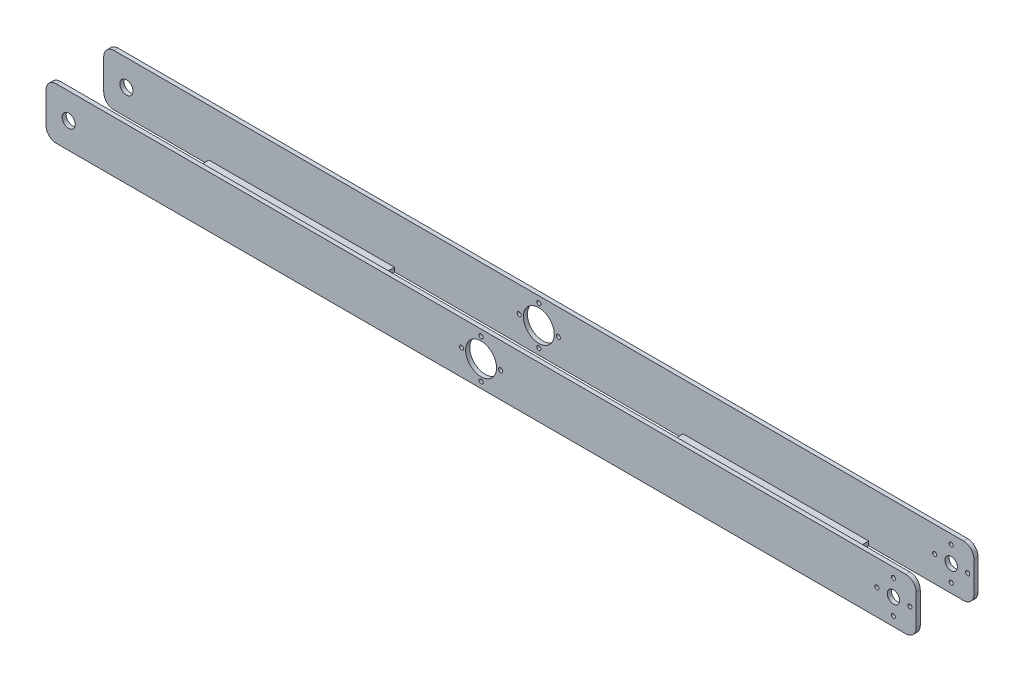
ISO-10303-21;
HEADER;
FILE_DESCRIPTION(('STEP AP214'),'2;1');
FILE_NAME('part.step','',(''),(''),'','','');
FILE_SCHEMA(('AUTOMOTIVE_DESIGN { 1 0 10303 214 1 1 1 1 }'));
ENDSEC;
DATA;
#1=APPLICATION_CONTEXT('core data for automotive mechanical design processes');
#2=APPLICATION_PROTOCOL_DEFINITION('international standard','automotive_design',2000,#1);
#3=PRODUCT_CONTEXT('',#1,'mechanical');
#4=PRODUCT('Part','Part','',(#3));
#5=PRODUCT_RELATED_PRODUCT_CATEGORY('part','',(#4));
#6=PRODUCT_DEFINITION_FORMATION('','',#4);
#7=PRODUCT_DEFINITION_CONTEXT('part definition',#1,'design');
#8=PRODUCT_DEFINITION('design','',#6,#7);
#9=PRODUCT_DEFINITION_SHAPE('','',#8);
#10=(LENGTH_UNIT() NAMED_UNIT(*) SI_UNIT(.MILLI.,.METRE.));
#11=(NAMED_UNIT(*) PLANE_ANGLE_UNIT() SI_UNIT($,.RADIAN.));
#12=(NAMED_UNIT(*) SI_UNIT($,.STERADIAN.) SOLID_ANGLE_UNIT());
#13=UNCERTAINTY_MEASURE_WITH_UNIT(LENGTH_MEASURE(1.E-05),#10,'distance_accuracy_value','');
#14=(GEOMETRIC_REPRESENTATION_CONTEXT(3) GLOBAL_UNCERTAINTY_ASSIGNED_CONTEXT((#13)) GLOBAL_UNIT_ASSIGNED_CONTEXT((#10,
#11,#12)) REPRESENTATION_CONTEXT('',''));
#15=CARTESIAN_POINT('',(0.,0.,0.));
#16=DIRECTION('',(0.,0.,1.));
#17=DIRECTION('',(1.,0.,0.));
#18=AXIS2_PLACEMENT_3D('',#15,#16,#17);
#19=CARTESIAN_POINT('',(211.,12.5,30.));
#20=DIRECTION('',(-1.,0.,0.));
#21=DIRECTION('',(0.,0.,1.));
#22=AXIS2_PLACEMENT_3D('',#19,#20,#21);
#23=PLANE('',#22);
#24=DIRECTION('',(0.,1.,0.));
#25=VECTOR('',#24,1.);
#26=CARTESIAN_POINT('',(211.,12.5,30.));
#27=LINE('',#26,#25);
#28=CARTESIAN_POINT('',(211.,-7.5,30.));
#29=VERTEX_POINT('',#28);
#30=CARTESIAN_POINT('',(211.,7.5,30.));
#31=VERTEX_POINT('',#30);
#32=EDGE_CURVE('E302',#29,#31,#27,.T.);
#33=ORIENTED_EDGE('',*,*,#32,.F.);
#34=DIRECTION('',(0.,0.,-1.));
#35=VECTOR('',#34,1.);
#36=CARTESIAN_POINT('',(211.,-7.5,30.));
#37=LINE('',#36,#35);
#38=CARTESIAN_POINT('',(211.,-7.5,28.));
#39=VERTEX_POINT('',#38);
#40=EDGE_CURVE('E403',#29,#39,#37,.T.);
#41=ORIENTED_EDGE('',*,*,#40,.T.);
#42=DIRECTION('',(0.,1.,0.));
#43=VECTOR('',#42,1.);
#44=CARTESIAN_POINT('',(211.,12.5,28.));
#45=LINE('',#44,#43);
#46=CARTESIAN_POINT('',(211.,7.5,28.));
#47=VERTEX_POINT('',#46);
#48=EDGE_CURVE('E299',#39,#47,#45,.T.);
#49=ORIENTED_EDGE('',*,*,#48,.T.);
#50=DIRECTION('',(0.,0.,-1.));
#51=VECTOR('',#50,1.);
#52=CARTESIAN_POINT('',(211.,7.5,30.));
#53=LINE('',#52,#51);
#54=EDGE_CURVE('E401',#47,#31,#53,.F.);
#55=ORIENTED_EDGE('',*,*,#54,.T.);
#56=EDGE_LOOP('',(#33,#41,#49,#55));
#57=FACE_BOUND('',#56,.T.);
#58=ADVANCED_FACE('F41',(#57),#23,.F.);
#59=CARTESIAN_POINT('',(-211.,-12.5,30.));
#60=DIRECTION('',(1.,0.,0.));
#61=DIRECTION('',(0.,0.,-1.));
#62=AXIS2_PLACEMENT_3D('',#59,#60,#61);
#63=PLANE('',#62);
#64=DIRECTION('',(0.,-1.,0.));
#65=VECTOR('',#64,1.);
#66=CARTESIAN_POINT('',(-211.,-12.5,0.));
#67=LINE('',#66,#65);
#68=CARTESIAN_POINT('',(-211.,7.5,0.));
#69=VERTEX_POINT('',#68);
#70=CARTESIAN_POINT('',(-211.,-7.5,0.));
#71=VERTEX_POINT('',#70);
#72=EDGE_CURVE('E320',#69,#71,#67,.T.);
#73=ORIENTED_EDGE('',*,*,#72,.T.);
#74=DIRECTION('',(0.,0.,-1.));
#75=VECTOR('',#74,1.);
#76=CARTESIAN_POINT('',(-211.,-7.5,30.));
#77=LINE('',#76,#75);
#78=CARTESIAN_POINT('',(-211.,-7.5,2.));
#79=VERTEX_POINT('',#78);
#80=EDGE_CURVE('E434',#71,#79,#77,.F.);
#81=ORIENTED_EDGE('',*,*,#80,.T.);
#82=DIRECTION('',(0.,-1.,0.));
#83=VECTOR('',#82,1.);
#84=CARTESIAN_POINT('',(-211.,-12.5,2.));
#85=LINE('',#84,#83);
#86=CARTESIAN_POINT('',(-211.,7.5,2.));
#87=VERTEX_POINT('',#86);
#88=EDGE_CURVE('E283',#87,#79,#85,.T.);
#89=ORIENTED_EDGE('',*,*,#88,.F.);
#90=DIRECTION('',(0.,0.,-1.));
#91=VECTOR('',#90,1.);
#92=CARTESIAN_POINT('',(-211.,7.5,30.));
#93=LINE('',#92,#91);
#94=EDGE_CURVE('E431',#87,#69,#93,.T.);
#95=ORIENTED_EDGE('',*,*,#94,.T.);
#96=EDGE_LOOP('',(#73,#81,#89,#95));
#97=FACE_BOUND('',#96,.T.);
#98=ADVANCED_FACE('F468',(#97),#63,.F.);
#99=CARTESIAN_POINT('',(-211.,-10.5,30.));
#100=DIRECTION('',(0.,1.,0.));
#101=DIRECTION('',(0.,0.,1.));
#102=AXIS2_PLACEMENT_3D('',#99,#100,#101);
#103=PLANE('',#102);
#104=DIRECTION('',(0.,0.,-1.));
#105=VECTOR('',#104,1.);
#106=CARTESIAN_POINT('',(-160.,-10.5,30.));
#107=LINE('',#106,#105);
#108=CARTESIAN_POINT('',(-160.,-10.5,28.));
#109=VERTEX_POINT('',#108);
#110=CARTESIAN_POINT('',(-160.,-10.5,2.));
#111=VERTEX_POINT('',#110);
#112=EDGE_CURVE('E276',#109,#111,#107,.T.);
#113=ORIENTED_EDGE('',*,*,#112,.F.);
#114=DIRECTION('',(1.,0.,0.));
#115=VECTOR('',#114,1.);
#116=CARTESIAN_POINT('',(-211.,-10.5,28.));
#117=LINE('',#116,#115);
#118=CARTESIAN_POINT('',(-70.,-10.5,28.));
#119=VERTEX_POINT('',#118);
#120=EDGE_CURVE('E221',#109,#119,#117,.T.);
#121=ORIENTED_EDGE('',*,*,#120,.T.);
#122=DIRECTION('',(0.,0.,1.));
#123=VECTOR('',#122,1.);
#124=CARTESIAN_POINT('',(-70.,-10.5,30.));
#125=LINE('',#124,#123);
#126=CARTESIAN_POINT('',(-70.,-10.5,2.));
#127=VERTEX_POINT('',#126);
#128=EDGE_CURVE('E273',#127,#119,#125,.T.);
#129=ORIENTED_EDGE('',*,*,#128,.F.);
#130=DIRECTION('',(1.,0.,0.));
#131=VECTOR('',#130,1.);
#132=CARTESIAN_POINT('',(-211.,-10.5,2.));
#133=LINE('',#132,#131);
#134=EDGE_CURVE('E282',#111,#127,#133,.T.);
#135=ORIENTED_EDGE('',*,*,#134,.F.);
#136=EDGE_LOOP('',(#113,#121,#129,#135));
#137=FACE_BOUND('',#136,.T.);
#138=ADVANCED_FACE('F474',(#137),#103,.T.);
#139=DIRECTION('',(0.,1.,0.));
#140=VECTOR('',#139,1.);
#141=CARTESIAN_POINT('',(211.,12.5,2.));
#142=LINE('',#141,#140);
#143=CARTESIAN_POINT('',(211.,-7.5,2.));
#144=VERTEX_POINT('',#143);
#145=CARTESIAN_POINT('',(211.,7.5,2.));
#146=VERTEX_POINT('',#145);
#147=EDGE_CURVE('E278',#144,#146,#142,.T.);
#148=ORIENTED_EDGE('',*,*,#147,.F.);
#149=DIRECTION('',(0.,0.,-1.));
#150=VECTOR('',#149,1.);
#151=CARTESIAN_POINT('',(211.,-7.5,30.));
#152=LINE('',#151,#150);
#153=CARTESIAN_POINT('',(211.,-7.5,0.));
#154=VERTEX_POINT('',#153);
#155=EDGE_CURVE('E374',#144,#154,#152,.T.);
#156=ORIENTED_EDGE('',*,*,#155,.T.);
#157=DIRECTION('',(0.,1.,0.));
#158=VECTOR('',#157,1.);
#159=CARTESIAN_POINT('',(211.,12.5,0.));
#160=LINE('',#159,#158);
#161=CARTESIAN_POINT('',(211.,7.5,0.));
#162=VERTEX_POINT('',#161);
#163=EDGE_CURVE('E314',#154,#162,#160,.T.);
#164=ORIENTED_EDGE('',*,*,#163,.T.);
#165=DIRECTION('',(0.,0.,-1.));
#166=VECTOR('',#165,1.);
#167=CARTESIAN_POINT('',(211.,7.5,30.));
#168=LINE('',#167,#166);
#169=EDGE_CURVE('E313',#162,#146,#168,.F.);
#170=ORIENTED_EDGE('',*,*,#169,.T.);
#171=EDGE_LOOP('',(#148,#156,#164,#170));
#172=FACE_BOUND('',#171,.T.);
#173=ADVANCED_FACE('F470',(#172),#23,.F.);
#174=CARTESIAN_POINT('',(-211.,12.5,30.));
#175=DIRECTION('',(0.,-1.,0.));
#176=DIRECTION('',(0.,0.,-1.));
#177=AXIS2_PLACEMENT_3D('',#174,#175,#176);
#178=PLANE('',#177);
#179=DIRECTION('',(-1.,0.,0.));
#180=VECTOR('',#179,1.);
#181=CARTESIAN_POINT('',(-211.,12.5,2.));
#182=LINE('',#181,#180);
#183=CARTESIAN_POINT('',(206.,12.5,2.));
#184=VERTEX_POINT('',#183);
#185=CARTESIAN_POINT('',(-206.,12.5,2.));
#186=VERTEX_POINT('',#185);
#187=EDGE_CURVE('E290',#184,#186,#182,.T.);
#188=ORIENTED_EDGE('',*,*,#187,.F.);
#189=DIRECTION('',(0.,0.,-1.));
#190=VECTOR('',#189,1.);
#191=CARTESIAN_POINT('',(206.,12.5,30.));
#192=LINE('',#191,#190);
#193=CARTESIAN_POINT('',(206.,12.5,0.));
#194=VERTEX_POINT('',#193);
#195=EDGE_CURVE('E428',#184,#194,#192,.T.);
#196=ORIENTED_EDGE('',*,*,#195,.T.);
#197=DIRECTION('',(-1.,0.,0.));
#198=VECTOR('',#197,1.);
#199=CARTESIAN_POINT('',(-211.,12.5,0.));
#200=LINE('',#199,#198);
#201=CARTESIAN_POINT('',(-206.,12.5,0.));
#202=VERTEX_POINT('',#201);
#203=EDGE_CURVE('E317',#194,#202,#200,.T.);
#204=ORIENTED_EDGE('',*,*,#203,.T.);
#205=DIRECTION('',(0.,0.,-1.));
#206=VECTOR('',#205,1.);
#207=CARTESIAN_POINT('',(-206.,12.5,30.));
#208=LINE('',#207,#206);
#209=EDGE_CURVE('E426',#202,#186,#208,.F.);
#210=ORIENTED_EDGE('',*,*,#209,.T.);
#211=EDGE_LOOP('',(#188,#196,#204,#210));
#212=FACE_BOUND('',#211,.T.);
#213=ADVANCED_FACE('F480',(#212),#178,.F.);
#214=DIRECTION('',(0.,-1.,0.));
#215=VECTOR('',#214,1.);
#216=CARTESIAN_POINT('',(-211.,-12.5,28.));
#217=LINE('',#216,#215);
#218=CARTESIAN_POINT('',(-211.,7.5,28.));
#219=VERTEX_POINT('',#218);
#220=CARTESIAN_POINT('',(-211.,-7.5,28.));
#221=VERTEX_POINT('',#220);
#222=EDGE_CURVE('E287',#219,#221,#217,.T.);
#223=ORIENTED_EDGE('',*,*,#222,.T.);
#224=DIRECTION('',(0.,0.,-1.));
#225=VECTOR('',#224,1.);
#226=CARTESIAN_POINT('',(-211.,-7.5,30.));
#227=LINE('',#226,#225);
#228=CARTESIAN_POINT('',(-211.,-7.5,30.));
#229=VERTEX_POINT('',#228);
#230=EDGE_CURVE('E11',#221,#229,#227,.F.);
#231=ORIENTED_EDGE('',*,*,#230,.T.);
#232=DIRECTION('',(0.,-1.,0.));
#233=VECTOR('',#232,1.);
#234=CARTESIAN_POINT('',(-211.,-12.5,30.));
#235=LINE('',#234,#233);
#236=CARTESIAN_POINT('',(-211.,7.5,30.));
#237=VERTEX_POINT('',#236);
#238=EDGE_CURVE('E308',#237,#229,#235,.T.);
#239=ORIENTED_EDGE('',*,*,#238,.F.);
#240=DIRECTION('',(0.,0.,-1.));
#241=VECTOR('',#240,1.);
#242=CARTESIAN_POINT('',(-211.,7.5,30.));
#243=LINE('',#242,#241);
#244=EDGE_CURVE('E49',#237,#219,#243,.T.);
#245=ORIENTED_EDGE('',*,*,#244,.T.);
#246=EDGE_LOOP('',(#223,#231,#239,#245));
#247=FACE_BOUND('',#246,.T.);
#248=ADVANCED_FACE('F438',(#247),#63,.F.);
#249=DIRECTION('',(-1.,0.,0.));
#250=VECTOR('',#249,1.);
#251=CARTESIAN_POINT('',(-211.,12.5,30.));
#252=LINE('',#251,#250);
#253=CARTESIAN_POINT('',(206.,12.5,30.));
#254=VERTEX_POINT('',#253);
#255=CARTESIAN_POINT('',(-206.,12.5,30.));
#256=VERTEX_POINT('',#255);
#257=EDGE_CURVE('E305',#254,#256,#252,.T.);
#258=ORIENTED_EDGE('',*,*,#257,.F.);
#259=DIRECTION('',(0.,0.,-1.));
#260=VECTOR('',#259,1.);
#261=CARTESIAN_POINT('',(206.,12.5,30.));
#262=LINE('',#261,#260);
#263=CARTESIAN_POINT('',(206.,12.5,28.));
#264=VERTEX_POINT('',#263);
#265=EDGE_CURVE('E423',#254,#264,#262,.T.);
#266=ORIENTED_EDGE('',*,*,#265,.T.);
#267=DIRECTION('',(-1.,0.,0.));
#268=VECTOR('',#267,1.);
#269=CARTESIAN_POINT('',(-211.,12.5,28.));
#270=LINE('',#269,#268);
#271=CARTESIAN_POINT('',(-206.,12.5,28.));
#272=VERTEX_POINT('',#271);
#273=EDGE_CURVE('E296',#264,#272,#270,.T.);
#274=ORIENTED_EDGE('',*,*,#273,.T.);
#275=DIRECTION('',(0.,0.,-1.));
#276=VECTOR('',#275,1.);
#277=CARTESIAN_POINT('',(-206.,12.5,30.));
#278=LINE('',#277,#276);
#279=EDGE_CURVE('E421',#272,#256,#278,.F.);
#280=ORIENTED_EDGE('',*,*,#279,.T.);
#281=EDGE_LOOP('',(#258,#266,#274,#280));
#282=FACE_BOUND('',#281,.T.);
#283=ADVANCED_FACE('F460',(#282),#178,.F.);
#284=CARTESIAN_POINT('',(-211.,-12.5,30.));
#285=DIRECTION('',(0.,1.,0.));
#286=DIRECTION('',(0.,0.,1.));
#287=AXIS2_PLACEMENT_3D('',#284,#285,#286);
#288=PLANE('',#287);
#289=DIRECTION('',(-1.,0.,0.));
#290=VECTOR('',#289,1.);
#291=CARTESIAN_POINT('',(-70.,-12.5,2.));
#292=LINE('',#291,#290);
#293=CARTESIAN_POINT('',(70.,-12.5,2.));
#294=VERTEX_POINT('',#293);
#295=CARTESIAN_POINT('',(-70.,-12.5,2.));
#296=VERTEX_POINT('',#295);
#297=EDGE_CURVE('E246',#294,#296,#292,.T.);
#298=ORIENTED_EDGE('',*,*,#297,.T.);
#299=DIRECTION('',(0.,0.,1.));
#300=VECTOR('',#299,1.);
#301=CARTESIAN_POINT('',(-70.,-12.5,2.));
#302=LINE('',#301,#300);
#303=CARTESIAN_POINT('',(-70.,-12.5,28.));
#304=VERTEX_POINT('',#303);
#305=EDGE_CURVE('E236',#296,#304,#302,.T.);
#306=ORIENTED_EDGE('',*,*,#305,.T.);
#307=DIRECTION('',(1.,0.,0.));
#308=VECTOR('',#307,1.);
#309=CARTESIAN_POINT('',(-70.,-12.5,28.));
#310=LINE('',#309,#308);
#311=CARTESIAN_POINT('',(70.,-12.5,28.));
#312=VERTEX_POINT('',#311);
#313=EDGE_CURVE('E239',#304,#312,#310,.T.);
#314=ORIENTED_EDGE('',*,*,#313,.T.);
#315=DIRECTION('',(0.,0.,-1.));
#316=VECTOR('',#315,1.);
#317=CARTESIAN_POINT('',(70.,-12.5,2.));
#318=LINE('',#317,#316);
#319=EDGE_CURVE('E243',#312,#294,#318,.T.);
#320=ORIENTED_EDGE('',*,*,#319,.T.);
#321=EDGE_LOOP('',(#298,#306,#314,#320));
#322=FACE_BOUND('',#321,.T.);
#323=DIRECTION('',(1.,0.,0.));
#324=VECTOR('',#323,1.);
#325=CARTESIAN_POINT('',(-211.,-12.5,0.));
#326=LINE('',#325,#324);
#327=CARTESIAN_POINT('',(-206.,-12.5,0.));
#328=VERTEX_POINT('',#327);
#329=CARTESIAN_POINT('',(206.,-12.5,0.));
#330=VERTEX_POINT('',#329);
#331=EDGE_CURVE('E306',#328,#330,#326,.T.);
#332=ORIENTED_EDGE('',*,*,#331,.T.);
#333=DIRECTION('',(0.,0.,-1.));
#334=VECTOR('',#333,1.);
#335=CARTESIAN_POINT('',(206.,-12.5,30.));
#336=LINE('',#335,#334);
#337=CARTESIAN_POINT('',(206.,-12.5,2.));
#338=VERTEX_POINT('',#337);
#339=EDGE_CURVE('E391',#330,#338,#336,.F.);
#340=ORIENTED_EDGE('',*,*,#339,.T.);
#341=DIRECTION('',(-1.,0.,0.));
#342=VECTOR('',#341,1.);
#343=CARTESIAN_POINT('',(211.,-12.5,2.));
#344=LINE('',#343,#342);
#345=CARTESIAN_POINT('',(160.,-12.5,2.00000000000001));
#346=VERTEX_POINT('',#345);
#347=EDGE_CURVE('E257',#338,#346,#344,.T.);
#348=ORIENTED_EDGE('',*,*,#347,.T.);
#349=DIRECTION('',(0.,0.,1.));
#350=VECTOR('',#349,1.);
#351=CARTESIAN_POINT('',(160.,-12.5,2.00000000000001));
#352=LINE('',#351,#350);
#353=CARTESIAN_POINT('',(160.,-12.5,28.));
#354=VERTEX_POINT('',#353);
#355=EDGE_CURVE('E259',#346,#354,#352,.T.);
#356=ORIENTED_EDGE('',*,*,#355,.T.);
#357=DIRECTION('',(1.,0.,0.));
#358=VECTOR('',#357,1.);
#359=CARTESIAN_POINT('',(211.,-12.5,28.));
#360=LINE('',#359,#358);
#361=CARTESIAN_POINT('',(206.,-12.5,28.));
#362=VERTEX_POINT('',#361);
#363=EDGE_CURVE('E263',#354,#362,#360,.T.);
#364=ORIENTED_EDGE('',*,*,#363,.T.);
#365=DIRECTION('',(0.,0.,-1.));
#366=VECTOR('',#365,1.);
#367=CARTESIAN_POINT('',(206.,-12.5,30.));
#368=LINE('',#367,#366);
#369=CARTESIAN_POINT('',(206.,-12.5,30.));
#370=VERTEX_POINT('',#369);
#371=EDGE_CURVE('E389',#362,#370,#368,.F.);
#372=ORIENTED_EDGE('',*,*,#371,.T.);
#373=DIRECTION('',(1.,0.,0.));
#374=VECTOR('',#373,1.);
#375=CARTESIAN_POINT('',(-211.,-12.5,30.));
#376=LINE('',#375,#374);
#377=CARTESIAN_POINT('',(-206.,-12.5,30.));
#378=VERTEX_POINT('',#377);
#379=EDGE_CURVE('E310',#378,#370,#376,.T.);
#380=ORIENTED_EDGE('',*,*,#379,.F.);
#381=DIRECTION('',(0.,0.,-1.));
#382=VECTOR('',#381,1.);
#383=CARTESIAN_POINT('',(-206.,-12.5,30.));
#384=LINE('',#383,#382);
#385=CARTESIAN_POINT('',(-206.,-12.5,28.));
#386=VERTEX_POINT('',#385);
#387=EDGE_CURVE('E212',#378,#386,#384,.T.);
#388=ORIENTED_EDGE('',*,*,#387,.T.);
#389=DIRECTION('',(1.,0.,0.));
#390=VECTOR('',#389,1.);
#391=CARTESIAN_POINT('',(-211.,-12.5,28.));
#392=LINE('',#391,#390);
#393=CARTESIAN_POINT('',(-160.,-12.5,28.));
#394=VERTEX_POINT('',#393);
#395=EDGE_CURVE('E203',#386,#394,#392,.T.);
#396=ORIENTED_EDGE('',*,*,#395,.T.);
#397=DIRECTION('',(0.,0.,-1.));
#398=VECTOR('',#397,1.);
#399=CARTESIAN_POINT('',(-160.,-12.5,2.));
#400=LINE('',#399,#398);
#401=CARTESIAN_POINT('',(-160.,-12.5,2.));
#402=VERTEX_POINT('',#401);
#403=EDGE_CURVE('E209',#394,#402,#400,.T.);
#404=ORIENTED_EDGE('',*,*,#403,.T.);
#405=DIRECTION('',(-1.,0.,0.));
#406=VECTOR('',#405,1.);
#407=CARTESIAN_POINT('',(-211.,-12.5,2.));
#408=LINE('',#407,#406);
#409=CARTESIAN_POINT('',(-206.,-12.5,2.));
#410=VERTEX_POINT('',#409);
#411=EDGE_CURVE('E225',#402,#410,#408,.T.);
#412=ORIENTED_EDGE('',*,*,#411,.T.);
#413=DIRECTION('',(0.,0.,-1.));
#414=VECTOR('',#413,1.);
#415=CARTESIAN_POINT('',(-206.,-12.5,30.));
#416=LINE('',#415,#414);
#417=EDGE_CURVE('E386',#410,#328,#416,.T.);
#418=ORIENTED_EDGE('',*,*,#417,.T.);
#419=EDGE_LOOP('',(#332,#340,#348,#356,#364,#372,#380,#388,#396,#404,#412,#418));
#420=FACE_BOUND('',#419,.T.);
#421=ADVANCED_FACE('F206',(#322,#420),#288,.F.);
#422=CARTESIAN_POINT('',(0.,0.,30.));
#423=DIRECTION('',(0.,0.,1.));
#424=DIRECTION('',(1.,0.,0.));
#425=AXIS2_PLACEMENT_3D('',#422,#423,#424);
#426=PLANE('',#425);
#427=CARTESIAN_POINT('',(200.,8.,30.));
#428=DIRECTION('',(0.,0.,-1.));
#429=DIRECTION('',(-1.,0.,0.));
#430=AXIS2_PLACEMENT_3D('',#427,#428,#429);
#431=CIRCLE('',#430,0.999999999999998);
#432=CARTESIAN_POINT('',(199.,8.,30.));
#433=VERTEX_POINT('',#432);
#434=EDGE_CURVE('E1118',#433,#433,#431,.T.);
#435=ORIENTED_EDGE('',*,*,#434,.T.);
#436=EDGE_LOOP('',(#435));
#437=FACE_BOUND('',#436,.T.);
#438=CARTESIAN_POINT('',(192.,0.,30.));
#439=DIRECTION('',(0.,0.,-1.));
#440=DIRECTION('',(-1.,0.,0.));
#441=AXIS2_PLACEMENT_3D('',#438,#439,#440);
#442=CIRCLE('',#441,0.999999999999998);
#443=CARTESIAN_POINT('',(191.,0.,30.));
#444=VERTEX_POINT('',#443);
#445=EDGE_CURVE('E1238',#444,#444,#442,.T.);
#446=ORIENTED_EDGE('',*,*,#445,.T.);
#447=EDGE_LOOP('',(#446));
#448=FACE_BOUND('',#447,.T.);
#449=CARTESIAN_POINT('',(208.,0.,30.));
#450=DIRECTION('',(0.,0.,-1.));
#451=DIRECTION('',(-1.,0.,0.));
#452=AXIS2_PLACEMENT_3D('',#449,#450,#451);
#453=CIRCLE('',#452,0.999999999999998);
#454=CARTESIAN_POINT('',(207.,0.,30.));
#455=VERTEX_POINT('',#454);
#456=EDGE_CURVE('E1241',#455,#455,#453,.T.);
#457=ORIENTED_EDGE('',*,*,#456,.T.);
#458=EDGE_LOOP('',(#457));
#459=FACE_BOUND('',#458,.T.);
#460=CARTESIAN_POINT('',(200.,-8.,30.));
#461=DIRECTION('',(0.,0.,-1.));
#462=DIRECTION('',(-1.,0.,0.));
#463=AXIS2_PLACEMENT_3D('',#460,#461,#462);
#464=CIRCLE('',#463,0.999999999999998);
#465=CARTESIAN_POINT('',(199.,-8.,30.));
#466=VERTEX_POINT('',#465);
#467=EDGE_CURVE('E1243',#466,#466,#464,.T.);
#468=ORIENTED_EDGE('',*,*,#467,.T.);
#469=EDGE_LOOP('',(#468));
#470=FACE_BOUND('',#469,.T.);
#471=CARTESIAN_POINT('',(200.,0.,30.));
#472=DIRECTION('',(0.,0.,-1.));
#473=DIRECTION('',(-1.,0.,0.));
#474=AXIS2_PLACEMENT_3D('',#471,#472,#473);
#475=CIRCLE('',#474,2.99999999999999);
#476=CARTESIAN_POINT('',(197.,0.,30.));
#477=VERTEX_POINT('',#476);
#478=EDGE_CURVE('E352',#477,#477,#475,.T.);
#479=ORIENTED_EDGE('',*,*,#478,.T.);
#480=EDGE_LOOP('',(#479));
#481=FACE_BOUND('',#480,.T.);
#482=CARTESIAN_POINT('',(0.,9.5,30.));
#483=DIRECTION('',(0.,0.,1.));
#484=DIRECTION('',(1.,0.,0.));
#485=AXIS2_PLACEMENT_3D('',#482,#483,#484);
#486=CIRCLE('',#485,1.);
#487=CARTESIAN_POINT('',(1.,9.5,30.));
#488=VERTEX_POINT('',#487);
#489=EDGE_CURVE('E1131',#488,#488,#486,.T.);
#490=ORIENTED_EDGE('',*,*,#489,.F.);
#491=EDGE_LOOP('',(#490));
#492=FACE_BOUND('',#491,.T.);
#493=CARTESIAN_POINT('',(-9.5,0.,30.));
#494=DIRECTION('',(0.,0.,1.));
#495=DIRECTION('',(1.,0.,0.));
#496=AXIS2_PLACEMENT_3D('',#493,#494,#495);
#497=CIRCLE('',#496,1.);
#498=CARTESIAN_POINT('',(-8.5,0.,30.));
#499=VERTEX_POINT('',#498);
#500=EDGE_CURVE('E1145',#499,#499,#497,.T.);
#501=ORIENTED_EDGE('',*,*,#500,.F.);
#502=EDGE_LOOP('',(#501));
#503=FACE_BOUND('',#502,.T.);
#504=CARTESIAN_POINT('',(0.,-9.5,30.));
#505=DIRECTION('',(0.,0.,1.));
#506=DIRECTION('',(1.,0.,0.));
#507=AXIS2_PLACEMENT_3D('',#504,#505,#506);
#508=CIRCLE('',#507,1.);
#509=CARTESIAN_POINT('',(1.,-9.5,30.));
#510=VERTEX_POINT('',#509);
#511=EDGE_CURVE('E1139',#510,#510,#508,.T.);
#512=ORIENTED_EDGE('',*,*,#511,.F.);
#513=EDGE_LOOP('',(#512));
#514=FACE_BOUND('',#513,.T.);
#515=CARTESIAN_POINT('',(0.,0.,30.));
#516=DIRECTION('',(0.,0.,1.));
#517=DIRECTION('',(1.,0.,0.));
#518=AXIS2_PLACEMENT_3D('',#515,#516,#517);
#519=CIRCLE('',#518,7.5);
#520=CARTESIAN_POINT('',(7.5,0.,30.));
#521=VERTEX_POINT('',#520);
#522=EDGE_CURVE('E1138',#521,#521,#519,.T.);
#523=ORIENTED_EDGE('',*,*,#522,.F.);
#524=EDGE_LOOP('',(#523));
#525=FACE_BOUND('',#524,.T.);
#526=CARTESIAN_POINT('',(9.5,0.,30.));
#527=DIRECTION('',(0.,0.,1.));
#528=DIRECTION('',(1.,0.,0.));
#529=AXIS2_PLACEMENT_3D('',#526,#527,#528);
#530=CIRCLE('',#529,1.);
#531=CARTESIAN_POINT('',(10.5,0.,30.));
#532=VERTEX_POINT('',#531);
#533=EDGE_CURVE('E1151',#532,#532,#530,.T.);
#534=ORIENTED_EDGE('',*,*,#533,.F.);
#535=EDGE_LOOP('',(#534));
#536=FACE_BOUND('',#535,.T.);
#537=CARTESIAN_POINT('',(-200.,0.,30.));
#538=DIRECTION('',(0.,0.,1.));
#539=DIRECTION('',(1.,0.,0.));
#540=AXIS2_PLACEMENT_3D('',#537,#538,#539);
#541=CIRCLE('',#540,3.20000000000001);
#542=CARTESIAN_POINT('',(-196.8,0.,30.));
#543=VERTEX_POINT('',#542);
#544=EDGE_CURVE('E1124',#543,#543,#541,.T.);
#545=ORIENTED_EDGE('',*,*,#544,.F.);
#546=EDGE_LOOP('',(#545));
#547=FACE_BOUND('',#546,.T.);
#548=ORIENTED_EDGE('',*,*,#379,.T.);
#549=CARTESIAN_POINT('',(206.,-7.5,30.));
#550=DIRECTION('',(0.,0.,1.));
#551=DIRECTION('',(1.,0.,0.));
#552=AXIS2_PLACEMENT_3D('',#549,#550,#551);
#553=CIRCLE('',#552,5.);
#554=EDGE_CURVE('E419',#370,#29,#553,.T.);
#555=ORIENTED_EDGE('',*,*,#554,.T.);
#556=ORIENTED_EDGE('',*,*,#32,.T.);
#557=CARTESIAN_POINT('',(206.,7.5,30.));
#558=DIRECTION('',(0.,0.,1.));
#559=DIRECTION('',(1.,0.,0.));
#560=AXIS2_PLACEMENT_3D('',#557,#558,#559);
#561=CIRCLE('',#560,5.);
#562=EDGE_CURVE('E417',#31,#254,#561,.T.);
#563=ORIENTED_EDGE('',*,*,#562,.T.);
#564=ORIENTED_EDGE('',*,*,#257,.T.);
#565=CARTESIAN_POINT('',(-206.,7.5,30.));
#566=DIRECTION('',(0.,0.,1.));
#567=DIRECTION('',(1.,0.,0.));
#568=AXIS2_PLACEMENT_3D('',#565,#566,#567);
#569=CIRCLE('',#568,5.);
#570=EDGE_CURVE('E61',#256,#237,#569,.T.);
#571=ORIENTED_EDGE('',*,*,#570,.T.);
#572=ORIENTED_EDGE('',*,*,#238,.T.);
#573=CARTESIAN_POINT('',(-206.,-7.5,30.));
#574=DIRECTION('',(0.,0.,1.));
#575=DIRECTION('',(1.,0.,0.));
#576=AXIS2_PLACEMENT_3D('',#573,#574,#575);
#577=CIRCLE('',#576,5.);
#578=EDGE_CURVE('E415',#229,#378,#577,.T.);
#579=ORIENTED_EDGE('',*,*,#578,.T.);
#580=EDGE_LOOP('',(#548,#555,#556,#563,#564,#571,#572,#579));
#581=FACE_BOUND('',#580,.T.);
#582=ADVANCED_FACE('F444',(#437,#448,#459,#470,#481,#492,#503,#514,#525,#536,#547,#581),#426,.T.);
#583=CARTESIAN_POINT('',(0.,0.,0.));
#584=DIRECTION('',(0.,0.,1.));
#585=DIRECTION('',(1.,0.,0.));
#586=AXIS2_PLACEMENT_3D('',#583,#584,#585);
#587=PLANE('',#586);
#588=CARTESIAN_POINT('',(200.,8.,0.));
#589=DIRECTION('',(0.,0.,1.));
#590=DIRECTION('',(1.,0.,0.));
#591=AXIS2_PLACEMENT_3D('',#588,#589,#590);
#592=CIRCLE('',#591,0.999999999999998);
#593=CARTESIAN_POINT('',(201.,8.,0.));
#594=VERTEX_POINT('',#593);
#595=EDGE_CURVE('E1121',#594,#594,#592,.T.);
#596=ORIENTED_EDGE('',*,*,#595,.T.);
#597=EDGE_LOOP('',(#596));
#598=FACE_BOUND('',#597,.T.);
#599=CARTESIAN_POINT('',(192.,0.,0.));
#600=DIRECTION('',(0.,0.,1.));
#601=DIRECTION('',(1.,0.,0.));
#602=AXIS2_PLACEMENT_3D('',#599,#600,#601);
#603=CIRCLE('',#602,0.999999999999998);
#604=CARTESIAN_POINT('',(193.,0.,0.));
#605=VERTEX_POINT('',#604);
#606=EDGE_CURVE('E372',#605,#605,#603,.T.);
#607=ORIENTED_EDGE('',*,*,#606,.T.);
#608=EDGE_LOOP('',(#607));
#609=FACE_BOUND('',#608,.T.);
#610=CARTESIAN_POINT('',(208.,0.,0.));
#611=DIRECTION('',(0.,0.,1.));
#612=DIRECTION('',(1.,0.,0.));
#613=AXIS2_PLACEMENT_3D('',#610,#611,#612);
#614=CIRCLE('',#613,0.999999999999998);
#615=CARTESIAN_POINT('',(209.,0.,0.));
#616=VERTEX_POINT('',#615);
#617=EDGE_CURVE('E367',#616,#616,#614,.T.);
#618=ORIENTED_EDGE('',*,*,#617,.T.);
#619=EDGE_LOOP('',(#618));
#620=FACE_BOUND('',#619,.T.);
#621=CARTESIAN_POINT('',(200.,-8.,0.));
#622=DIRECTION('',(0.,0.,1.));
#623=DIRECTION('',(1.,0.,0.));
#624=AXIS2_PLACEMENT_3D('',#621,#622,#623);
#625=CIRCLE('',#624,0.999999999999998);
#626=CARTESIAN_POINT('',(201.,-8.,0.));
#627=VERTEX_POINT('',#626);
#628=EDGE_CURVE('E362',#627,#627,#625,.T.);
#629=ORIENTED_EDGE('',*,*,#628,.T.);
#630=EDGE_LOOP('',(#629));
#631=FACE_BOUND('',#630,.T.);
#632=CARTESIAN_POINT('',(200.,0.,0.));
#633=DIRECTION('',(0.,0.,1.));
#634=DIRECTION('',(1.,0.,0.));
#635=AXIS2_PLACEMENT_3D('',#632,#633,#634);
#636=CIRCLE('',#635,2.99999999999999);
#637=CARTESIAN_POINT('',(203.,0.,0.));
#638=VERTEX_POINT('',#637);
#639=EDGE_CURVE('E357',#638,#638,#636,.T.);
#640=ORIENTED_EDGE('',*,*,#639,.T.);
#641=EDGE_LOOP('',(#640));
#642=FACE_BOUND('',#641,.T.);
#643=CARTESIAN_POINT('',(0.,9.5,0.));
#644=DIRECTION('',(0.,0.,1.));
#645=DIRECTION('',(1.,0.,0.));
#646=AXIS2_PLACEMENT_3D('',#643,#644,#645);
#647=CIRCLE('',#646,1.);
#648=CARTESIAN_POINT('',(1.,9.5,0.));
#649=VERTEX_POINT('',#648);
#650=EDGE_CURVE('E328',#649,#649,#647,.T.);
#651=ORIENTED_EDGE('',*,*,#650,.T.);
#652=EDGE_LOOP('',(#651));
#653=FACE_BOUND('',#652,.T.);
#654=CARTESIAN_POINT('',(-9.5,0.,0.));
#655=DIRECTION('',(0.,0.,1.));
#656=DIRECTION('',(1.,0.,0.));
#657=AXIS2_PLACEMENT_3D('',#654,#655,#656);
#658=CIRCLE('',#657,1.);
#659=CARTESIAN_POINT('',(-8.5,0.,0.));
#660=VERTEX_POINT('',#659);
#661=EDGE_CURVE('E1142',#660,#660,#658,.T.);
#662=ORIENTED_EDGE('',*,*,#661,.T.);
#663=EDGE_LOOP('',(#662));
#664=FACE_BOUND('',#663,.T.);
#665=CARTESIAN_POINT('',(0.,-9.5,0.));
#666=DIRECTION('',(0.,0.,1.));
#667=DIRECTION('',(1.,0.,0.));
#668=AXIS2_PLACEMENT_3D('',#665,#666,#667);
#669=CIRCLE('',#668,1.);
#670=CARTESIAN_POINT('',(1.,-9.5,0.));
#671=VERTEX_POINT('',#670);
#672=EDGE_CURVE('E1135',#671,#671,#669,.T.);
#673=ORIENTED_EDGE('',*,*,#672,.T.);
#674=EDGE_LOOP('',(#673));
#675=FACE_BOUND('',#674,.T.);
#676=CARTESIAN_POINT('',(0.,0.,0.));
#677=DIRECTION('',(0.,0.,1.));
#678=DIRECTION('',(1.,0.,0.));
#679=AXIS2_PLACEMENT_3D('',#676,#677,#678);
#680=CIRCLE('',#679,7.5);
#681=CARTESIAN_POINT('',(7.5,0.,0.));
#682=VERTEX_POINT('',#681);
#683=EDGE_CURVE('E1154',#682,#682,#680,.T.);
#684=ORIENTED_EDGE('',*,*,#683,.T.);
#685=EDGE_LOOP('',(#684));
#686=FACE_BOUND('',#685,.T.);
#687=CARTESIAN_POINT('',(9.5,0.,0.));
#688=DIRECTION('',(0.,0.,1.));
#689=DIRECTION('',(1.,0.,0.));
#690=AXIS2_PLACEMENT_3D('',#687,#688,#689);
#691=CIRCLE('',#690,1.);
#692=CARTESIAN_POINT('',(10.5,0.,0.));
#693=VERTEX_POINT('',#692);
#694=EDGE_CURVE('E1134',#693,#693,#691,.T.);
#695=ORIENTED_EDGE('',*,*,#694,.T.);
#696=EDGE_LOOP('',(#695));
#697=FACE_BOUND('',#696,.T.);
#698=CARTESIAN_POINT('',(-200.,0.,0.));
#699=DIRECTION('',(0.,0.,1.));
#700=DIRECTION('',(1.,0.,0.));
#701=AXIS2_PLACEMENT_3D('',#698,#699,#700);
#702=CIRCLE('',#701,3.20000000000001);
#703=CARTESIAN_POINT('',(-196.8,0.,0.));
#704=VERTEX_POINT('',#703);
#705=EDGE_CURVE('E1148',#704,#704,#702,.T.);
#706=ORIENTED_EDGE('',*,*,#705,.T.);
#707=EDGE_LOOP('',(#706));
#708=FACE_BOUND('',#707,.T.);
#709=ORIENTED_EDGE('',*,*,#163,.F.);
#710=CARTESIAN_POINT('',(206.,-7.5,0.));
#711=DIRECTION('',(0.,0.,1.));
#712=DIRECTION('',(1.,0.,0.));
#713=AXIS2_PLACEMENT_3D('',#710,#711,#712);
#714=CIRCLE('',#713,5.);
#715=EDGE_CURVE('E383',#154,#330,#714,.F.);
#716=ORIENTED_EDGE('',*,*,#715,.T.);
#717=ORIENTED_EDGE('',*,*,#331,.F.);
#718=CARTESIAN_POINT('',(-206.,-7.5,0.));
#719=DIRECTION('',(0.,0.,1.));
#720=DIRECTION('',(1.,0.,0.));
#721=AXIS2_PLACEMENT_3D('',#718,#719,#720);
#722=CIRCLE('',#721,5.);
#723=EDGE_CURVE('E379',#328,#71,#722,.F.);
#724=ORIENTED_EDGE('',*,*,#723,.T.);
#725=ORIENTED_EDGE('',*,*,#72,.F.);
#726=CARTESIAN_POINT('',(-206.,7.5,0.));
#727=DIRECTION('',(0.,0.,1.));
#728=DIRECTION('',(1.,0.,0.));
#729=AXIS2_PLACEMENT_3D('',#726,#727,#728);
#730=CIRCLE('',#729,5.);
#731=EDGE_CURVE('E377',#69,#202,#730,.F.);
#732=ORIENTED_EDGE('',*,*,#731,.T.);
#733=ORIENTED_EDGE('',*,*,#203,.F.);
#734=CARTESIAN_POINT('',(206.,7.5,0.));
#735=DIRECTION('',(0.,0.,1.));
#736=DIRECTION('',(1.,0.,0.));
#737=AXIS2_PLACEMENT_3D('',#734,#735,#736);
#738=CIRCLE('',#737,5.);
#739=EDGE_CURVE('E381',#194,#162,#738,.F.);
#740=ORIENTED_EDGE('',*,*,#739,.T.);
#741=EDGE_LOOP('',(#709,#716,#717,#724,#725,#732,#733,#740));
#742=FACE_BOUND('',#741,.T.);
#743=ADVANCED_FACE('F502',(#598,#609,#620,#631,#642,#653,#664,#675,#686,#697,#708,#742),#587,.F.);
#744=DIRECTION('',(0.,0.,-1.));
#745=VECTOR('',#744,1.);
#746=CARTESIAN_POINT('',(70.,-10.5,30.));
#747=LINE('',#746,#745);
#748=CARTESIAN_POINT('',(70.,-10.5,28.));
#749=VERTEX_POINT('',#748);
#750=CARTESIAN_POINT('',(70.,-10.5,2.));
#751=VERTEX_POINT('',#750);
#752=EDGE_CURVE('E271',#749,#751,#747,.T.);
#753=ORIENTED_EDGE('',*,*,#752,.F.);
#754=CARTESIAN_POINT('',(160.,-10.5,28.));
#755=VERTEX_POINT('',#754);
#756=EDGE_CURVE('E284',#749,#755,#117,.T.);
#757=ORIENTED_EDGE('',*,*,#756,.T.);
#758=DIRECTION('',(0.,0.,1.));
#759=VECTOR('',#758,1.);
#760=CARTESIAN_POINT('',(160.,-10.5,30.));
#761=LINE('',#760,#759);
#762=CARTESIAN_POINT('',(160.,-10.5,2.00000000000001));
#763=VERTEX_POINT('',#762);
#764=EDGE_CURVE('E234',#763,#755,#761,.T.);
#765=ORIENTED_EDGE('',*,*,#764,.F.);
#766=EDGE_CURVE('E279',#751,#763,#133,.T.);
#767=ORIENTED_EDGE('',*,*,#766,.F.);
#768=EDGE_LOOP('',(#753,#757,#765,#767));
#769=FACE_BOUND('',#768,.T.);
#770=ADVANCED_FACE('F489',(#769),#103,.T.);
#771=CARTESIAN_POINT('',(0.,0.,28.));
#772=DIRECTION('',(0.,0.,1.));
#773=DIRECTION('',(1.,0.,0.));
#774=AXIS2_PLACEMENT_3D('',#771,#772,#773);
#775=PLANE('',#774);
#776=CARTESIAN_POINT('',(200.,8.,28.));
#777=DIRECTION('',(0.,0.,1.));
#778=DIRECTION('',(1.,0.,0.));
#779=AXIS2_PLACEMENT_3D('',#776,#777,#778);
#780=CIRCLE('',#779,0.999999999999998);
#781=CARTESIAN_POINT('',(201.,8.,28.));
#782=VERTEX_POINT('',#781);
#783=EDGE_CURVE('E371',#782,#782,#780,.T.);
#784=ORIENTED_EDGE('',*,*,#783,.T.);
#785=EDGE_LOOP('',(#784));
#786=FACE_BOUND('',#785,.T.);
#787=CARTESIAN_POINT('',(192.,0.,28.));
#788=DIRECTION('',(0.,0.,1.));
#789=DIRECTION('',(1.,0.,0.));
#790=AXIS2_PLACEMENT_3D('',#787,#788,#789);
#791=CIRCLE('',#790,0.999999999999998);
#792=CARTESIAN_POINT('',(193.,0.,28.));
#793=VERTEX_POINT('',#792);
#794=EDGE_CURVE('E366',#793,#793,#791,.T.);
#795=ORIENTED_EDGE('',*,*,#794,.T.);
#796=EDGE_LOOP('',(#795));
#797=FACE_BOUND('',#796,.T.);
#798=CARTESIAN_POINT('',(208.,0.,28.));
#799=DIRECTION('',(0.,0.,1.));
#800=DIRECTION('',(1.,0.,0.));
#801=AXIS2_PLACEMENT_3D('',#798,#799,#800);
#802=CIRCLE('',#801,0.999999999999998);
#803=CARTESIAN_POINT('',(209.,0.,28.));
#804=VERTEX_POINT('',#803);
#805=EDGE_CURVE('E361',#804,#804,#802,.T.);
#806=ORIENTED_EDGE('',*,*,#805,.T.);
#807=EDGE_LOOP('',(#806));
#808=FACE_BOUND('',#807,.T.);
#809=CARTESIAN_POINT('',(200.,-8.,28.));
#810=DIRECTION('',(0.,0.,1.));
#811=DIRECTION('',(1.,0.,0.));
#812=AXIS2_PLACEMENT_3D('',#809,#810,#811);
#813=CIRCLE('',#812,0.999999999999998);
#814=CARTESIAN_POINT('',(201.,-8.,28.));
#815=VERTEX_POINT('',#814);
#816=EDGE_CURVE('E356',#815,#815,#813,.T.);
#817=ORIENTED_EDGE('',*,*,#816,.T.);
#818=EDGE_LOOP('',(#817));
#819=FACE_BOUND('',#818,.T.);
#820=CARTESIAN_POINT('',(200.,0.,28.));
#821=DIRECTION('',(0.,0.,1.));
#822=DIRECTION('',(1.,0.,0.));
#823=AXIS2_PLACEMENT_3D('',#820,#821,#822);
#824=CIRCLE('',#823,2.99999999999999);
#825=CARTESIAN_POINT('',(203.,0.,28.));
#826=VERTEX_POINT('',#825);
#827=EDGE_CURVE('E351',#826,#826,#824,.T.);
#828=ORIENTED_EDGE('',*,*,#827,.T.);
#829=EDGE_LOOP('',(#828));
#830=FACE_BOUND('',#829,.T.);
#831=CARTESIAN_POINT('',(0.,9.5,28.));
#832=DIRECTION('',(0.,0.,1.));
#833=DIRECTION('',(1.,0.,0.));
#834=AXIS2_PLACEMENT_3D('',#831,#832,#833);
#835=CIRCLE('',#834,1.);
#836=CARTESIAN_POINT('',(1.,9.5,28.));
#837=VERTEX_POINT('',#836);
#838=EDGE_CURVE('E260',#837,#837,#835,.T.);
#839=ORIENTED_EDGE('',*,*,#838,.T.);
#840=EDGE_LOOP('',(#839));
#841=FACE_BOUND('',#840,.T.);
#842=CARTESIAN_POINT('',(-9.5,0.,28.));
#843=DIRECTION('',(0.,0.,1.));
#844=DIRECTION('',(1.,0.,0.));
#845=AXIS2_PLACEMENT_3D('',#842,#843,#844);
#846=CIRCLE('',#845,1.);
#847=CARTESIAN_POINT('',(-8.5,0.,28.));
#848=VERTEX_POINT('',#847);
#849=EDGE_CURVE('E344',#848,#848,#846,.T.);
#850=ORIENTED_EDGE('',*,*,#849,.T.);
#851=EDGE_LOOP('',(#850));
#852=FACE_BOUND('',#851,.T.);
#853=CARTESIAN_POINT('',(0.,-9.5,28.));
#854=DIRECTION('',(0.,0.,1.));
#855=DIRECTION('',(1.,0.,0.));
#856=AXIS2_PLACEMENT_3D('',#853,#854,#855);
#857=CIRCLE('',#856,1.);
#858=CARTESIAN_POINT('',(1.,-9.5,28.));
#859=VERTEX_POINT('',#858);
#860=EDGE_CURVE('E340',#859,#859,#857,.T.);
#861=ORIENTED_EDGE('',*,*,#860,.T.);
#862=EDGE_LOOP('',(#861));
#863=FACE_BOUND('',#862,.T.);
#864=CARTESIAN_POINT('',(0.,0.,28.));
#865=DIRECTION('',(0.,0.,1.));
#866=DIRECTION('',(1.,0.,0.));
#867=AXIS2_PLACEMENT_3D('',#864,#865,#866);
#868=CIRCLE('',#867,7.5);
#869=CARTESIAN_POINT('',(7.5,0.,28.));
#870=VERTEX_POINT('',#869);
#871=EDGE_CURVE('E336',#870,#870,#868,.T.);
#872=ORIENTED_EDGE('',*,*,#871,.T.);
#873=EDGE_LOOP('',(#872));
#874=FACE_BOUND('',#873,.T.);
#875=CARTESIAN_POINT('',(9.5,0.,28.));
#876=DIRECTION('',(0.,0.,1.));
#877=DIRECTION('',(1.,0.,0.));
#878=AXIS2_PLACEMENT_3D('',#875,#876,#877);
#879=CIRCLE('',#878,1.);
#880=CARTESIAN_POINT('',(10.5,0.,28.));
#881=VERTEX_POINT('',#880);
#882=EDGE_CURVE('E332',#881,#881,#879,.T.);
#883=ORIENTED_EDGE('',*,*,#882,.T.);
#884=EDGE_LOOP('',(#883));
#885=FACE_BOUND('',#884,.T.);
#886=CARTESIAN_POINT('',(-200.,0.,28.));
#887=DIRECTION('',(0.,0.,1.));
#888=DIRECTION('',(1.,0.,0.));
#889=AXIS2_PLACEMENT_3D('',#886,#887,#888);
#890=CIRCLE('',#889,3.20000000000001);
#891=CARTESIAN_POINT('',(-196.8,0.,28.));
#892=VERTEX_POINT('',#891);
#893=EDGE_CURVE('E327',#892,#892,#890,.T.);
#894=ORIENTED_EDGE('',*,*,#893,.T.);
#895=EDGE_LOOP('',(#894));
#896=FACE_BOUND('',#895,.T.);
#897=ORIENTED_EDGE('',*,*,#48,.F.);
#898=CARTESIAN_POINT('',(206.,-7.5,28.));
#899=DIRECTION('',(0.,0.,1.));
#900=DIRECTION('',(1.,0.,0.));
#901=AXIS2_PLACEMENT_3D('',#898,#899,#900);
#902=CIRCLE('',#901,5.);
#903=EDGE_CURVE('E412',#39,#362,#902,.F.);
#904=ORIENTED_EDGE('',*,*,#903,.T.);
#905=ORIENTED_EDGE('',*,*,#363,.F.);
#906=DIRECTION('',(0.,1.,0.));
#907=VECTOR('',#906,1.);
#908=CARTESIAN_POINT('',(160.,-12.5,28.));
#909=LINE('',#908,#907);
#910=EDGE_CURVE('E240',#354,#755,#909,.T.);
#911=ORIENTED_EDGE('',*,*,#910,.T.);
#912=ORIENTED_EDGE('',*,*,#756,.F.);
#913=DIRECTION('',(0.,1.,0.));
#914=VECTOR('',#913,1.);
#915=CARTESIAN_POINT('',(70.,-12.5,28.));
#916=LINE('',#915,#914);
#917=EDGE_CURVE('E254',#312,#749,#916,.T.);
#918=ORIENTED_EDGE('',*,*,#917,.F.);
#919=ORIENTED_EDGE('',*,*,#313,.F.);
#920=DIRECTION('',(0.,1.,0.));
#921=VECTOR('',#920,1.);
#922=CARTESIAN_POINT('',(-70.,-12.5,28.));
#923=LINE('',#922,#921);
#924=EDGE_CURVE('E249',#304,#119,#923,.T.);
#925=ORIENTED_EDGE('',*,*,#924,.T.);
#926=ORIENTED_EDGE('',*,*,#120,.F.);
#927=DIRECTION('',(0.,1.,0.));
#928=VECTOR('',#927,1.);
#929=CARTESIAN_POINT('',(-160.,-12.5,28.));
#930=LINE('',#929,#928);
#931=EDGE_CURVE('E217',#394,#109,#930,.T.);
#932=ORIENTED_EDGE('',*,*,#931,.F.);
#933=ORIENTED_EDGE('',*,*,#395,.F.);
#934=CARTESIAN_POINT('',(-206.,-7.5,28.));
#935=DIRECTION('',(0.,0.,1.));
#936=DIRECTION('',(1.,0.,0.));
#937=AXIS2_PLACEMENT_3D('',#934,#935,#936);
#938=CIRCLE('',#937,5.);
#939=EDGE_CURVE('E408',#386,#221,#938,.F.);
#940=ORIENTED_EDGE('',*,*,#939,.T.);
#941=ORIENTED_EDGE('',*,*,#222,.F.);
#942=CARTESIAN_POINT('',(-206.,7.5,28.));
#943=DIRECTION('',(0.,0.,1.));
#944=DIRECTION('',(1.,0.,0.));
#945=AXIS2_PLACEMENT_3D('',#942,#943,#944);
#946=CIRCLE('',#945,5.);
#947=EDGE_CURVE('E406',#219,#272,#946,.F.);
#948=ORIENTED_EDGE('',*,*,#947,.T.);
#949=ORIENTED_EDGE('',*,*,#273,.F.);
#950=CARTESIAN_POINT('',(206.,7.5,28.));
#951=DIRECTION('',(0.,0.,1.));
#952=DIRECTION('',(1.,0.,0.));
#953=AXIS2_PLACEMENT_3D('',#950,#951,#952);
#954=CIRCLE('',#953,5.);
#955=EDGE_CURVE('E410',#264,#47,#954,.F.);
#956=ORIENTED_EDGE('',*,*,#955,.T.);
#957=EDGE_LOOP('',(#897,#904,#905,#911,#912,#918,#919,#925,#926,#932,#933,#940,#941,#948,#949,#956));
#958=FACE_BOUND('',#957,.T.);
#959=ADVANCED_FACE('F219',(#786,#797,#808,#819,#830,#841,#852,#863,#874,#885,#896,#958),#775,.F.);
#960=CARTESIAN_POINT('',(0.,0.,2.));
#961=DIRECTION('',(0.,0.,1.));
#962=DIRECTION('',(1.,0.,0.));
#963=AXIS2_PLACEMENT_3D('',#960,#961,#962);
#964=PLANE('',#963);
#965=CARTESIAN_POINT('',(200.,8.,2.));
#966=DIRECTION('',(0.,0.,1.));
#967=DIRECTION('',(1.,0.,0.));
#968=AXIS2_PLACEMENT_3D('',#965,#966,#967);
#969=CIRCLE('',#968,0.999999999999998);
#970=CARTESIAN_POINT('',(201.,8.,2.));
#971=VERTEX_POINT('',#970);
#972=EDGE_CURVE('E368',#971,#971,#969,.T.);
#973=ORIENTED_EDGE('',*,*,#972,.F.);
#974=EDGE_LOOP('',(#973));
#975=FACE_BOUND('',#974,.T.);
#976=CARTESIAN_POINT('',(192.,0.,2.));
#977=DIRECTION('',(0.,0.,1.));
#978=DIRECTION('',(1.,0.,0.));
#979=AXIS2_PLACEMENT_3D('',#976,#977,#978);
#980=CIRCLE('',#979,0.999999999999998);
#981=CARTESIAN_POINT('',(193.,0.,2.));
#982=VERTEX_POINT('',#981);
#983=EDGE_CURVE('E363',#982,#982,#980,.T.);
#984=ORIENTED_EDGE('',*,*,#983,.F.);
#985=EDGE_LOOP('',(#984));
#986=FACE_BOUND('',#985,.T.);
#987=CARTESIAN_POINT('',(208.,0.,2.));
#988=DIRECTION('',(0.,0.,1.));
#989=DIRECTION('',(1.,0.,0.));
#990=AXIS2_PLACEMENT_3D('',#987,#988,#989);
#991=CIRCLE('',#990,0.999999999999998);
#992=CARTESIAN_POINT('',(209.,0.,2.));
#993=VERTEX_POINT('',#992);
#994=EDGE_CURVE('E358',#993,#993,#991,.T.);
#995=ORIENTED_EDGE('',*,*,#994,.F.);
#996=EDGE_LOOP('',(#995));
#997=FACE_BOUND('',#996,.T.);
#998=CARTESIAN_POINT('',(200.,-8.,2.));
#999=DIRECTION('',(0.,0.,1.));
#1000=DIRECTION('',(1.,0.,0.));
#1001=AXIS2_PLACEMENT_3D('',#998,#999,#1000);
#1002=CIRCLE('',#1001,0.999999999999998);
#1003=CARTESIAN_POINT('',(201.,-8.,2.));
#1004=VERTEX_POINT('',#1003);
#1005=EDGE_CURVE('E353',#1004,#1004,#1002,.T.);
#1006=ORIENTED_EDGE('',*,*,#1005,.F.);
#1007=EDGE_LOOP('',(#1006));
#1008=FACE_BOUND('',#1007,.T.);
#1009=CARTESIAN_POINT('',(200.,0.,2.));
#1010=DIRECTION('',(0.,0.,1.));
#1011=DIRECTION('',(1.,0.,0.));
#1012=AXIS2_PLACEMENT_3D('',#1009,#1010,#1011);
#1013=CIRCLE('',#1012,2.99999999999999);
#1014=CARTESIAN_POINT('',(203.,0.,2.));
#1015=VERTEX_POINT('',#1014);
#1016=EDGE_CURVE('E348',#1015,#1015,#1013,.T.);
#1017=ORIENTED_EDGE('',*,*,#1016,.F.);
#1018=EDGE_LOOP('',(#1017));
#1019=FACE_BOUND('',#1018,.T.);
#1020=CARTESIAN_POINT('',(0.,9.5,2.));
#1021=DIRECTION('',(0.,0.,1.));
#1022=DIRECTION('',(1.,0.,0.));
#1023=AXIS2_PLACEMENT_3D('',#1020,#1021,#1022);
#1024=CIRCLE('',#1023,1.);
#1025=CARTESIAN_POINT('',(1.,9.5,2.));
#1026=VERTEX_POINT('',#1025);
#1027=EDGE_CURVE('E345',#1026,#1026,#1024,.T.);
#1028=ORIENTED_EDGE('',*,*,#1027,.F.);
#1029=EDGE_LOOP('',(#1028));
#1030=FACE_BOUND('',#1029,.T.);
#1031=CARTESIAN_POINT('',(-9.5,0.,2.));
#1032=DIRECTION('',(0.,0.,1.));
#1033=DIRECTION('',(1.,0.,0.));
#1034=AXIS2_PLACEMENT_3D('',#1031,#1032,#1033);
#1035=CIRCLE('',#1034,1.);
#1036=CARTESIAN_POINT('',(-8.5,0.,2.));
#1037=VERTEX_POINT('',#1036);
#1038=EDGE_CURVE('E341',#1037,#1037,#1035,.T.);
#1039=ORIENTED_EDGE('',*,*,#1038,.F.);
#1040=EDGE_LOOP('',(#1039));
#1041=FACE_BOUND('',#1040,.T.);
#1042=CARTESIAN_POINT('',(0.,-9.5,2.));
#1043=DIRECTION('',(0.,0.,1.));
#1044=DIRECTION('',(1.,0.,0.));
#1045=AXIS2_PLACEMENT_3D('',#1042,#1043,#1044);
#1046=CIRCLE('',#1045,1.);
#1047=CARTESIAN_POINT('',(1.,-9.5,2.));
#1048=VERTEX_POINT('',#1047);
#1049=EDGE_CURVE('E337',#1048,#1048,#1046,.T.);
#1050=ORIENTED_EDGE('',*,*,#1049,.F.);
#1051=EDGE_LOOP('',(#1050));
#1052=FACE_BOUND('',#1051,.T.);
#1053=CARTESIAN_POINT('',(0.,0.,2.));
#1054=DIRECTION('',(0.,0.,1.));
#1055=DIRECTION('',(1.,0.,0.));
#1056=AXIS2_PLACEMENT_3D('',#1053,#1054,#1055);
#1057=CIRCLE('',#1056,7.5);
#1058=CARTESIAN_POINT('',(7.5,0.,2.));
#1059=VERTEX_POINT('',#1058);
#1060=EDGE_CURVE('E333',#1059,#1059,#1057,.T.);
#1061=ORIENTED_EDGE('',*,*,#1060,.F.);
#1062=EDGE_LOOP('',(#1061));
#1063=FACE_BOUND('',#1062,.T.);
#1064=CARTESIAN_POINT('',(9.5,0.,2.));
#1065=DIRECTION('',(0.,0.,1.));
#1066=DIRECTION('',(1.,0.,0.));
#1067=AXIS2_PLACEMENT_3D('',#1064,#1065,#1066);
#1068=CIRCLE('',#1067,1.);
#1069=CARTESIAN_POINT('',(10.5,0.,2.));
#1070=VERTEX_POINT('',#1069);
#1071=EDGE_CURVE('E329',#1070,#1070,#1068,.T.);
#1072=ORIENTED_EDGE('',*,*,#1071,.F.);
#1073=EDGE_LOOP('',(#1072));
#1074=FACE_BOUND('',#1073,.T.);
#1075=CARTESIAN_POINT('',(-200.,0.,2.));
#1076=DIRECTION('',(0.,0.,1.));
#1077=DIRECTION('',(1.,0.,0.));
#1078=AXIS2_PLACEMENT_3D('',#1075,#1076,#1077);
#1079=CIRCLE('',#1078,3.20000000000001);
#1080=CARTESIAN_POINT('',(-196.8,0.,2.));
#1081=VERTEX_POINT('',#1080);
#1082=EDGE_CURVE('E324',#1081,#1081,#1079,.T.);
#1083=ORIENTED_EDGE('',*,*,#1082,.F.);
#1084=EDGE_LOOP('',(#1083));
#1085=FACE_BOUND('',#1084,.T.);
#1086=ORIENTED_EDGE('',*,*,#347,.F.);
#1087=CARTESIAN_POINT('',(206.,-7.5,2.));
#1088=DIRECTION('',(0.,0.,1.));
#1089=DIRECTION('',(1.,0.,0.));
#1090=AXIS2_PLACEMENT_3D('',#1087,#1088,#1089);
#1091=CIRCLE('',#1090,5.);
#1092=EDGE_CURVE('E399',#338,#144,#1091,.T.);
#1093=ORIENTED_EDGE('',*,*,#1092,.T.);
#1094=ORIENTED_EDGE('',*,*,#147,.T.);
#1095=CARTESIAN_POINT('',(206.,7.5,2.));
#1096=DIRECTION('',(0.,0.,1.));
#1097=DIRECTION('',(1.,0.,0.));
#1098=AXIS2_PLACEMENT_3D('',#1095,#1096,#1097);
#1099=CIRCLE('',#1098,5.);
#1100=EDGE_CURVE('E397',#146,#184,#1099,.T.);
#1101=ORIENTED_EDGE('',*,*,#1100,.T.);
#1102=ORIENTED_EDGE('',*,*,#187,.T.);
#1103=CARTESIAN_POINT('',(-206.,7.5,2.));
#1104=DIRECTION('',(0.,0.,1.));
#1105=DIRECTION('',(1.,0.,0.));
#1106=AXIS2_PLACEMENT_3D('',#1103,#1104,#1105);
#1107=CIRCLE('',#1106,5.);
#1108=EDGE_CURVE('E393',#186,#87,#1107,.T.);
#1109=ORIENTED_EDGE('',*,*,#1108,.T.);
#1110=ORIENTED_EDGE('',*,*,#88,.T.);
#1111=CARTESIAN_POINT('',(-206.,-7.5,2.));
#1112=DIRECTION('',(0.,0.,1.));
#1113=DIRECTION('',(1.,0.,0.));
#1114=AXIS2_PLACEMENT_3D('',#1111,#1112,#1113);
#1115=CIRCLE('',#1114,5.);
#1116=EDGE_CURVE('E395',#79,#410,#1115,.T.);
#1117=ORIENTED_EDGE('',*,*,#1116,.T.);
#1118=ORIENTED_EDGE('',*,*,#411,.F.);
#1119=DIRECTION('',(0.,1.,0.));
#1120=VECTOR('',#1119,1.);
#1121=CARTESIAN_POINT('',(-160.,-12.5,2.));
#1122=LINE('',#1121,#1120);
#1123=EDGE_CURVE('E224',#402,#111,#1122,.T.);
#1124=ORIENTED_EDGE('',*,*,#1123,.T.);
#1125=ORIENTED_EDGE('',*,*,#134,.T.);
#1126=DIRECTION('',(0.,1.,0.));
#1127=VECTOR('',#1126,1.);
#1128=CARTESIAN_POINT('',(-70.,-12.5,2.));
#1129=LINE('',#1128,#1127);
#1130=EDGE_CURVE('E214',#296,#127,#1129,.T.);
#1131=ORIENTED_EDGE('',*,*,#1130,.F.);
#1132=ORIENTED_EDGE('',*,*,#297,.F.);
#1133=DIRECTION('',(0.,1.,0.));
#1134=VECTOR('',#1133,1.);
#1135=CARTESIAN_POINT('',(70.,-12.5,2.));
#1136=LINE('',#1135,#1134);
#1137=EDGE_CURVE('E251',#294,#751,#1136,.T.);
#1138=ORIENTED_EDGE('',*,*,#1137,.T.);
#1139=ORIENTED_EDGE('',*,*,#766,.T.);
#1140=DIRECTION('',(0.,1.,0.));
#1141=VECTOR('',#1140,1.);
#1142=CARTESIAN_POINT('',(160.,-12.5,2.00000000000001));
#1143=LINE('',#1142,#1141);
#1144=EDGE_CURVE('E266',#346,#763,#1143,.T.);
#1145=ORIENTED_EDGE('',*,*,#1144,.F.);
#1146=EDGE_LOOP('',(#1086,#1093,#1094,#1101,#1102,#1109,#1110,#1117,#1118,#1124,#1125,#1131,
#1132,#1138,#1139,#1145));
#1147=FACE_BOUND('',#1146,.T.);
#1148=ADVANCED_FACE('F520',(#975,#986,#997,#1008,#1019,#1030,#1041,#1052,#1063,#1074,#1085,
#1147),#964,.T.);
#1149=CARTESIAN_POINT('',(160.,-12.5,2.00000000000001));
#1150=DIRECTION('',(-1.,0.,0.));
#1151=DIRECTION('',(0.,0.,1.));
#1152=AXIS2_PLACEMENT_3D('',#1149,#1150,#1151);
#1153=PLANE('',#1152);
#1154=ORIENTED_EDGE('',*,*,#764,.T.);
#1155=ORIENTED_EDGE('',*,*,#910,.F.);
#1156=ORIENTED_EDGE('',*,*,#355,.F.);
#1157=ORIENTED_EDGE('',*,*,#1144,.T.);
#1158=EDGE_LOOP('',(#1154,#1155,#1156,#1157));
#1159=FACE_BOUND('',#1158,.T.);
#1160=ADVANCED_FACE('F541',(#1159),#1153,.F.);
#1161=CARTESIAN_POINT('',(-70.,-12.5,2.));
#1162=DIRECTION('',(-1.,0.,0.));
#1163=DIRECTION('',(0.,0.,1.));
#1164=AXIS2_PLACEMENT_3D('',#1161,#1162,#1163);
#1165=PLANE('',#1164);
#1166=ORIENTED_EDGE('',*,*,#128,.T.);
#1167=ORIENTED_EDGE('',*,*,#924,.F.);
#1168=ORIENTED_EDGE('',*,*,#305,.F.);
#1169=ORIENTED_EDGE('',*,*,#1130,.T.);
#1170=EDGE_LOOP('',(#1166,#1167,#1168,#1169));
#1171=FACE_BOUND('',#1170,.T.);
#1172=ADVANCED_FACE('F525',(#1171),#1165,.F.);
#1173=CARTESIAN_POINT('',(70.,-12.5,2.));
#1174=DIRECTION('',(1.,0.,0.));
#1175=DIRECTION('',(0.,0.,-1.));
#1176=AXIS2_PLACEMENT_3D('',#1173,#1174,#1175);
#1177=PLANE('',#1176);
#1178=ORIENTED_EDGE('',*,*,#752,.T.);
#1179=ORIENTED_EDGE('',*,*,#1137,.F.);
#1180=ORIENTED_EDGE('',*,*,#319,.F.);
#1181=ORIENTED_EDGE('',*,*,#917,.T.);
#1182=EDGE_LOOP('',(#1178,#1179,#1180,#1181));
#1183=FACE_BOUND('',#1182,.T.);
#1184=ADVANCED_FACE('F533',(#1183),#1177,.F.);
#1185=CARTESIAN_POINT('',(-160.,-12.5,2.));
#1186=DIRECTION('',(1.,0.,0.));
#1187=DIRECTION('',(0.,0.,-1.));
#1188=AXIS2_PLACEMENT_3D('',#1185,#1186,#1187);
#1189=PLANE('',#1188);
#1190=ORIENTED_EDGE('',*,*,#112,.T.);
#1191=ORIENTED_EDGE('',*,*,#1123,.F.);
#1192=ORIENTED_EDGE('',*,*,#403,.F.);
#1193=ORIENTED_EDGE('',*,*,#931,.T.);
#1194=EDGE_LOOP('',(#1190,#1191,#1192,#1193));
#1195=FACE_BOUND('',#1194,.T.);
#1196=ADVANCED_FACE('F227',(#1195),#1189,.F.);
#1197=CARTESIAN_POINT('',(-200.,0.,0.));
#1198=DIRECTION('',(0.,0.,1.));
#1199=DIRECTION('',(1.,0.,0.));
#1200=AXIS2_PLACEMENT_3D('',#1197,#1198,#1199);
#1201=CYLINDRICAL_SURFACE('',#1200,3.20000000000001);
#1202=ORIENTED_EDGE('',*,*,#1082,.T.);
#1203=EDGE_LOOP('',(#1202));
#1204=FACE_BOUND('',#1203,.T.);
#1205=ORIENTED_EDGE('',*,*,#705,.F.);
#1206=EDGE_LOOP('',(#1205));
#1207=FACE_BOUND('',#1206,.T.);
#1208=ADVANCED_FACE('F621',(#1204,#1207),#1201,.F.);
#1209=CARTESIAN_POINT('',(9.5,0.,0.));
#1210=DIRECTION('',(0.,0.,1.));
#1211=DIRECTION('',(1.,0.,0.));
#1212=AXIS2_PLACEMENT_3D('',#1209,#1210,#1211);
#1213=CYLINDRICAL_SURFACE('',#1212,1.);
#1214=ORIENTED_EDGE('',*,*,#1071,.T.);
#1215=EDGE_LOOP('',(#1214));
#1216=FACE_BOUND('',#1215,.T.);
#1217=ORIENTED_EDGE('',*,*,#694,.F.);
#1218=EDGE_LOOP('',(#1217));
#1219=FACE_BOUND('',#1218,.T.);
#1220=ADVANCED_FACE('F630',(#1216,#1219),#1213,.F.);
#1221=CARTESIAN_POINT('',(0.,0.,0.));
#1222=DIRECTION('',(0.,0.,1.));
#1223=DIRECTION('',(1.,0.,0.));
#1224=AXIS2_PLACEMENT_3D('',#1221,#1222,#1223);
#1225=CYLINDRICAL_SURFACE('',#1224,7.5);
#1226=ORIENTED_EDGE('',*,*,#1060,.T.);
#1227=EDGE_LOOP('',(#1226));
#1228=FACE_BOUND('',#1227,.T.);
#1229=ORIENTED_EDGE('',*,*,#683,.F.);
#1230=EDGE_LOOP('',(#1229));
#1231=FACE_BOUND('',#1230,.T.);
#1232=ADVANCED_FACE('F641',(#1228,#1231),#1225,.F.);
#1233=CARTESIAN_POINT('',(0.,-9.5,0.));
#1234=DIRECTION('',(0.,0.,1.));
#1235=DIRECTION('',(1.,0.,0.));
#1236=AXIS2_PLACEMENT_3D('',#1233,#1234,#1235);
#1237=CYLINDRICAL_SURFACE('',#1236,1.);
#1238=ORIENTED_EDGE('',*,*,#1049,.T.);
#1239=EDGE_LOOP('',(#1238));
#1240=FACE_BOUND('',#1239,.T.);
#1241=ORIENTED_EDGE('',*,*,#672,.F.);
#1242=EDGE_LOOP('',(#1241));
#1243=FACE_BOUND('',#1242,.T.);
#1244=ADVANCED_FACE('F652',(#1240,#1243),#1237,.F.);
#1245=CARTESIAN_POINT('',(-9.5,0.,0.));
#1246=DIRECTION('',(0.,0.,1.));
#1247=DIRECTION('',(1.,0.,0.));
#1248=AXIS2_PLACEMENT_3D('',#1245,#1246,#1247);
#1249=CYLINDRICAL_SURFACE('',#1248,1.);
#1250=ORIENTED_EDGE('',*,*,#1038,.T.);
#1251=EDGE_LOOP('',(#1250));
#1252=FACE_BOUND('',#1251,.T.);
#1253=ORIENTED_EDGE('',*,*,#661,.F.);
#1254=EDGE_LOOP('',(#1253));
#1255=FACE_BOUND('',#1254,.T.);
#1256=ADVANCED_FACE('F663',(#1252,#1255),#1249,.F.);
#1257=CARTESIAN_POINT('',(0.,9.5,0.));
#1258=DIRECTION('',(0.,0.,1.));
#1259=DIRECTION('',(1.,0.,0.));
#1260=AXIS2_PLACEMENT_3D('',#1257,#1258,#1259);
#1261=CYLINDRICAL_SURFACE('',#1260,1.);
#1262=ORIENTED_EDGE('',*,*,#1027,.T.);
#1263=EDGE_LOOP('',(#1262));
#1264=FACE_BOUND('',#1263,.T.);
#1265=ORIENTED_EDGE('',*,*,#650,.F.);
#1266=EDGE_LOOP('',(#1265));
#1267=FACE_BOUND('',#1266,.T.);
#1268=ADVANCED_FACE('F674',(#1264,#1267),#1261,.F.);
#1269=ORIENTED_EDGE('',*,*,#544,.T.);
#1270=EDGE_LOOP('',(#1269));
#1271=FACE_BOUND('',#1270,.T.);
#1272=ORIENTED_EDGE('',*,*,#893,.F.);
#1273=EDGE_LOOP('',(#1272));
#1274=FACE_BOUND('',#1273,.T.);
#1275=ADVANCED_FACE('F633',(#1271,#1274),#1201,.F.);
#1276=ORIENTED_EDGE('',*,*,#533,.T.);
#1277=EDGE_LOOP('',(#1276));
#1278=FACE_BOUND('',#1277,.T.);
#1279=ORIENTED_EDGE('',*,*,#882,.F.);
#1280=EDGE_LOOP('',(#1279));
#1281=FACE_BOUND('',#1280,.T.);
#1282=ADVANCED_FACE('F644',(#1278,#1281),#1213,.F.);
#1283=ORIENTED_EDGE('',*,*,#522,.T.);
#1284=EDGE_LOOP('',(#1283));
#1285=FACE_BOUND('',#1284,.T.);
#1286=ORIENTED_EDGE('',*,*,#871,.F.);
#1287=EDGE_LOOP('',(#1286));
#1288=FACE_BOUND('',#1287,.T.);
#1289=ADVANCED_FACE('F655',(#1285,#1288),#1225,.F.);
#1290=ORIENTED_EDGE('',*,*,#511,.T.);
#1291=EDGE_LOOP('',(#1290));
#1292=FACE_BOUND('',#1291,.T.);
#1293=ORIENTED_EDGE('',*,*,#860,.F.);
#1294=EDGE_LOOP('',(#1293));
#1295=FACE_BOUND('',#1294,.T.);
#1296=ADVANCED_FACE('F666',(#1292,#1295),#1237,.F.);
#1297=ORIENTED_EDGE('',*,*,#500,.T.);
#1298=EDGE_LOOP('',(#1297));
#1299=FACE_BOUND('',#1298,.T.);
#1300=ORIENTED_EDGE('',*,*,#849,.F.);
#1301=EDGE_LOOP('',(#1300));
#1302=FACE_BOUND('',#1301,.T.);
#1303=ADVANCED_FACE('F677',(#1299,#1302),#1249,.F.);
#1304=ORIENTED_EDGE('',*,*,#489,.T.);
#1305=EDGE_LOOP('',(#1304));
#1306=FACE_BOUND('',#1305,.T.);
#1307=ORIENTED_EDGE('',*,*,#838,.F.);
#1308=EDGE_LOOP('',(#1307));
#1309=FACE_BOUND('',#1308,.T.);
#1310=ADVANCED_FACE('F687',(#1306,#1309),#1261,.F.);
#1311=CARTESIAN_POINT('',(200.,0.,30.));
#1312=DIRECTION('',(0.,0.,-1.));
#1313=DIRECTION('',(-1.,0.,0.));
#1314=AXIS2_PLACEMENT_3D('',#1311,#1312,#1313);
#1315=CYLINDRICAL_SURFACE('',#1314,2.99999999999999);
#1316=ORIENTED_EDGE('',*,*,#1016,.T.);
#1317=EDGE_LOOP('',(#1316));
#1318=FACE_BOUND('',#1317,.T.);
#1319=ORIENTED_EDGE('',*,*,#639,.F.);
#1320=EDGE_LOOP('',(#1319));
#1321=FACE_BOUND('',#1320,.T.);
#1322=ADVANCED_FACE('F735',(#1318,#1321),#1315,.F.);
#1323=CARTESIAN_POINT('',(200.,-8.,30.));
#1324=DIRECTION('',(0.,0.,-1.));
#1325=DIRECTION('',(-1.,0.,0.));
#1326=AXIS2_PLACEMENT_3D('',#1323,#1324,#1325);
#1327=CYLINDRICAL_SURFACE('',#1326,0.999999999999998);
#1328=ORIENTED_EDGE('',*,*,#1005,.T.);
#1329=EDGE_LOOP('',(#1328));
#1330=FACE_BOUND('',#1329,.T.);
#1331=ORIENTED_EDGE('',*,*,#628,.F.);
#1332=EDGE_LOOP('',(#1331));
#1333=FACE_BOUND('',#1332,.T.);
#1334=ADVANCED_FACE('F744',(#1330,#1333),#1327,.F.);
#1335=CARTESIAN_POINT('',(208.,0.,30.));
#1336=DIRECTION('',(0.,0.,-1.));
#1337=DIRECTION('',(-1.,0.,0.));
#1338=AXIS2_PLACEMENT_3D('',#1335,#1336,#1337);
#1339=CYLINDRICAL_SURFACE('',#1338,0.999999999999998);
#1340=ORIENTED_EDGE('',*,*,#994,.T.);
#1341=EDGE_LOOP('',(#1340));
#1342=FACE_BOUND('',#1341,.T.);
#1343=ORIENTED_EDGE('',*,*,#617,.F.);
#1344=EDGE_LOOP('',(#1343));
#1345=FACE_BOUND('',#1344,.T.);
#1346=ADVANCED_FACE('F755',(#1342,#1345),#1339,.F.);
#1347=CARTESIAN_POINT('',(192.,0.,30.));
#1348=DIRECTION('',(0.,0.,-1.));
#1349=DIRECTION('',(-1.,0.,0.));
#1350=AXIS2_PLACEMENT_3D('',#1347,#1348,#1349);
#1351=CYLINDRICAL_SURFACE('',#1350,0.999999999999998);
#1352=ORIENTED_EDGE('',*,*,#983,.T.);
#1353=EDGE_LOOP('',(#1352));
#1354=FACE_BOUND('',#1353,.T.);
#1355=ORIENTED_EDGE('',*,*,#606,.F.);
#1356=EDGE_LOOP('',(#1355));
#1357=FACE_BOUND('',#1356,.T.);
#1358=ADVANCED_FACE('F766',(#1354,#1357),#1351,.F.);
#1359=CARTESIAN_POINT('',(200.,8.,30.));
#1360=DIRECTION('',(0.,0.,-1.));
#1361=DIRECTION('',(-1.,0.,0.));
#1362=AXIS2_PLACEMENT_3D('',#1359,#1360,#1361);
#1363=CYLINDRICAL_SURFACE('',#1362,0.999999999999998);
#1364=ORIENTED_EDGE('',*,*,#972,.T.);
#1365=EDGE_LOOP('',(#1364));
#1366=FACE_BOUND('',#1365,.T.);
#1367=ORIENTED_EDGE('',*,*,#595,.F.);
#1368=EDGE_LOOP('',(#1367));
#1369=FACE_BOUND('',#1368,.T.);
#1370=ADVANCED_FACE('F777',(#1366,#1369),#1363,.F.);
#1371=ORIENTED_EDGE('',*,*,#478,.F.);
#1372=EDGE_LOOP('',(#1371));
#1373=FACE_BOUND('',#1372,.T.);
#1374=ORIENTED_EDGE('',*,*,#827,.F.);
#1375=EDGE_LOOP('',(#1374));
#1376=FACE_BOUND('',#1375,.T.);
#1377=ADVANCED_FACE('F747',(#1373,#1376),#1315,.F.);
#1378=ORIENTED_EDGE('',*,*,#467,.F.);
#1379=EDGE_LOOP('',(#1378));
#1380=FACE_BOUND('',#1379,.T.);
#1381=ORIENTED_EDGE('',*,*,#816,.F.);
#1382=EDGE_LOOP('',(#1381));
#1383=FACE_BOUND('',#1382,.T.);
#1384=ADVANCED_FACE('F758',(#1380,#1383),#1327,.F.);
#1385=ORIENTED_EDGE('',*,*,#456,.F.);
#1386=EDGE_LOOP('',(#1385));
#1387=FACE_BOUND('',#1386,.T.);
#1388=ORIENTED_EDGE('',*,*,#805,.F.);
#1389=EDGE_LOOP('',(#1388));
#1390=FACE_BOUND('',#1389,.T.);
#1391=ADVANCED_FACE('F769',(#1387,#1390),#1339,.F.);
#1392=ORIENTED_EDGE('',*,*,#445,.F.);
#1393=EDGE_LOOP('',(#1392));
#1394=FACE_BOUND('',#1393,.T.);
#1395=ORIENTED_EDGE('',*,*,#794,.F.);
#1396=EDGE_LOOP('',(#1395));
#1397=FACE_BOUND('',#1396,.T.);
#1398=ADVANCED_FACE('F780',(#1394,#1397),#1351,.F.);
#1399=ORIENTED_EDGE('',*,*,#434,.F.);
#1400=EDGE_LOOP('',(#1399));
#1401=FACE_BOUND('',#1400,.T.);
#1402=ORIENTED_EDGE('',*,*,#783,.F.);
#1403=EDGE_LOOP('',(#1402));
#1404=FACE_BOUND('',#1403,.T.);
#1405=ADVANCED_FACE('F790',(#1401,#1404),#1363,.F.);
#1406=CARTESIAN_POINT('',(206.,-7.5,30.));
#1407=DIRECTION('',(0.,0.,-1.));
#1408=DIRECTION('',(-1.,0.,0.));
#1409=AXIS2_PLACEMENT_3D('',#1406,#1407,#1408);
#1410=CYLINDRICAL_SURFACE('',#1409,5.);
#1411=ORIENTED_EDGE('',*,*,#1092,.F.);
#1412=ORIENTED_EDGE('',*,*,#339,.F.);
#1413=ORIENTED_EDGE('',*,*,#715,.F.);
#1414=ORIENTED_EDGE('',*,*,#155,.F.);
#1415=EDGE_LOOP('',(#1411,#1412,#1413,#1414));
#1416=FACE_BOUND('',#1415,.T.);
#1417=ADVANCED_FACE('F498',(#1416),#1410,.T.);
#1418=CARTESIAN_POINT('',(206.,-7.5,30.));
#1419=DIRECTION('',(0.,0.,-1.));
#1420=DIRECTION('',(-1.,0.,0.));
#1421=AXIS2_PLACEMENT_3D('',#1418,#1419,#1420);
#1422=CYLINDRICAL_SURFACE('',#1421,5.);
#1423=ORIENTED_EDGE('',*,*,#554,.F.);
#1424=ORIENTED_EDGE('',*,*,#371,.F.);
#1425=ORIENTED_EDGE('',*,*,#903,.F.);
#1426=ORIENTED_EDGE('',*,*,#40,.F.);
#1427=EDGE_LOOP('',(#1423,#1424,#1425,#1426));
#1428=FACE_BOUND('',#1427,.T.);
#1429=ADVANCED_FACE('F449',(#1428),#1422,.T.);
#1430=CARTESIAN_POINT('',(206.,7.5,30.));
#1431=DIRECTION('',(0.,0.,-1.));
#1432=DIRECTION('',(-1.,0.,0.));
#1433=AXIS2_PLACEMENT_3D('',#1430,#1431,#1432);
#1434=CYLINDRICAL_SURFACE('',#1433,5.);
#1435=ORIENTED_EDGE('',*,*,#562,.F.);
#1436=ORIENTED_EDGE('',*,*,#54,.F.);
#1437=ORIENTED_EDGE('',*,*,#955,.F.);
#1438=ORIENTED_EDGE('',*,*,#265,.F.);
#1439=EDGE_LOOP('',(#1435,#1436,#1437,#1438));
#1440=FACE_BOUND('',#1439,.T.);
#1441=ADVANCED_FACE('F456',(#1440),#1434,.T.);
#1442=CARTESIAN_POINT('',(206.,7.5,30.));
#1443=DIRECTION('',(0.,0.,-1.));
#1444=DIRECTION('',(-1.,0.,0.));
#1445=AXIS2_PLACEMENT_3D('',#1442,#1443,#1444);
#1446=CYLINDRICAL_SURFACE('',#1445,5.);
#1447=ORIENTED_EDGE('',*,*,#1100,.F.);
#1448=ORIENTED_EDGE('',*,*,#169,.F.);
#1449=ORIENTED_EDGE('',*,*,#739,.F.);
#1450=ORIENTED_EDGE('',*,*,#195,.F.);
#1451=EDGE_LOOP('',(#1447,#1448,#1449,#1450));
#1452=FACE_BOUND('',#1451,.T.);
#1453=ADVANCED_FACE('F519',(#1452),#1446,.T.);
#1454=CARTESIAN_POINT('',(-206.,-7.5,30.));
#1455=DIRECTION('',(0.,0.,-1.));
#1456=DIRECTION('',(-1.,0.,0.));
#1457=AXIS2_PLACEMENT_3D('',#1454,#1455,#1456);
#1458=CYLINDRICAL_SURFACE('',#1457,5.);
#1459=ORIENTED_EDGE('',*,*,#1116,.F.);
#1460=ORIENTED_EDGE('',*,*,#80,.F.);
#1461=ORIENTED_EDGE('',*,*,#723,.F.);
#1462=ORIENTED_EDGE('',*,*,#417,.F.);
#1463=EDGE_LOOP('',(#1459,#1460,#1461,#1462));
#1464=FACE_BOUND('',#1463,.T.);
#1465=ADVANCED_FACE('F507',(#1464),#1458,.T.);
#1466=CARTESIAN_POINT('',(-206.,7.5,30.));
#1467=DIRECTION('',(0.,0.,-1.));
#1468=DIRECTION('',(-1.,0.,0.));
#1469=AXIS2_PLACEMENT_3D('',#1466,#1467,#1468);
#1470=CYLINDRICAL_SURFACE('',#1469,5.);
#1471=ORIENTED_EDGE('',*,*,#1108,.F.);
#1472=ORIENTED_EDGE('',*,*,#209,.F.);
#1473=ORIENTED_EDGE('',*,*,#731,.F.);
#1474=ORIENTED_EDGE('',*,*,#94,.F.);
#1475=EDGE_LOOP('',(#1471,#1472,#1473,#1474));
#1476=FACE_BOUND('',#1475,.T.);
#1477=ADVANCED_FACE('F466',(#1476),#1470,.T.);
#1478=CARTESIAN_POINT('',(-206.,-7.5,30.));
#1479=DIRECTION('',(0.,0.,-1.));
#1480=DIRECTION('',(-1.,0.,0.));
#1481=AXIS2_PLACEMENT_3D('',#1478,#1479,#1480);
#1482=CYLINDRICAL_SURFACE('',#1481,5.);
#1483=ORIENTED_EDGE('',*,*,#578,.F.);
#1484=ORIENTED_EDGE('',*,*,#230,.F.);
#1485=ORIENTED_EDGE('',*,*,#939,.F.);
#1486=ORIENTED_EDGE('',*,*,#387,.F.);
#1487=EDGE_LOOP('',(#1483,#1484,#1485,#1486));
#1488=FACE_BOUND('',#1487,.T.);
#1489=ADVANCED_FACE('F443',(#1488),#1482,.T.);
#1490=CARTESIAN_POINT('',(-206.,7.5,30.));
#1491=DIRECTION('',(0.,0.,-1.));
#1492=DIRECTION('',(-1.,0.,0.));
#1493=AXIS2_PLACEMENT_3D('',#1490,#1491,#1492);
#1494=CYLINDRICAL_SURFACE('',#1493,5.);
#1495=ORIENTED_EDGE('',*,*,#570,.F.);
#1496=ORIENTED_EDGE('',*,*,#279,.F.);
#1497=ORIENTED_EDGE('',*,*,#947,.F.);
#1498=ORIENTED_EDGE('',*,*,#244,.F.);
#1499=EDGE_LOOP('',(#1495,#1496,#1497,#1498));
#1500=FACE_BOUND('',#1499,.T.);
#1501=ADVANCED_FACE('F43',(#1500),#1494,.T.);
#1502=CLOSED_SHELL('',(#58,#98,#138,#173,#213,#248,#283,#421,#582,#743,#770,#959,#1148,#1160,
#1172,#1184,#1196,#1208,#1220,#1232,#1244,#1256,#1268,#1275,#1282,#1289,#1296,#1303,#1310,#1322,
#1334,#1346,#1358,#1370,#1377,#1384,#1391,#1398,#1405,#1417,#1429,#1441,#1453,#1465,#1477,#1489,#1501));
#1503=MANIFOLD_SOLID_BREP('B2',#1502);
#1504=ADVANCED_BREP_SHAPE_REPRESENTATION('',(#18,#1503),#14);
#1505=SHAPE_DEFINITION_REPRESENTATION(#9,#1504);
ENDSEC;
END-ISO-10303-21;
